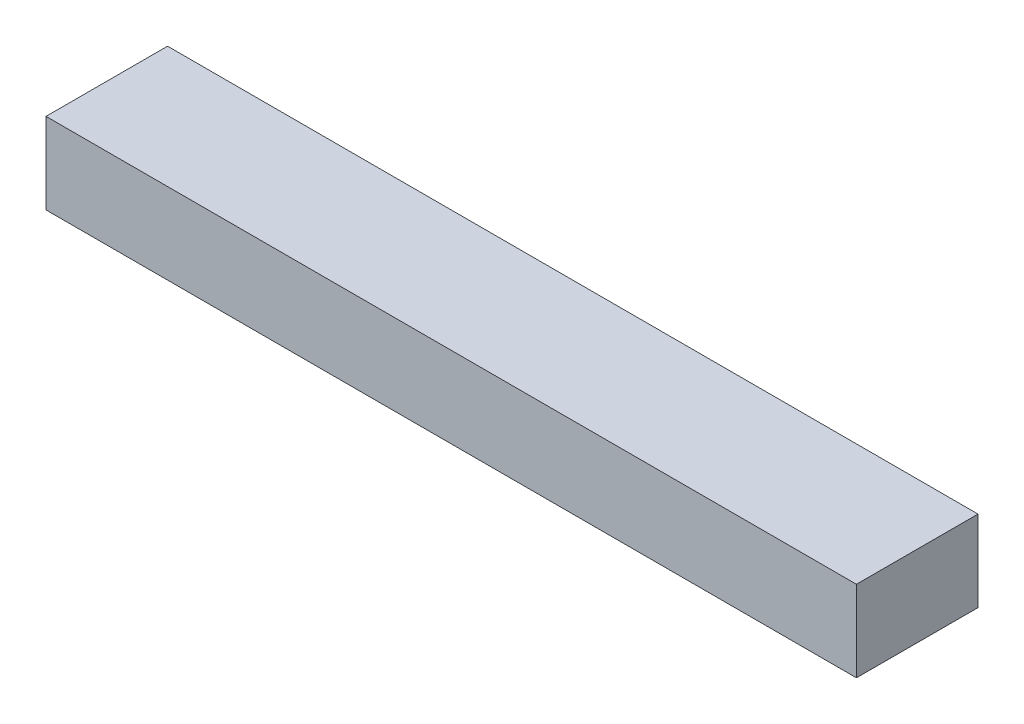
ISO-10303-21;
HEADER;
FILE_DESCRIPTION(('STEP AP214'),'2;1');
FILE_NAME('part.step','',(''),(''),'','','');
FILE_SCHEMA(('AUTOMOTIVE_DESIGN { 1 0 10303 214 1 1 1 1 }'));
ENDSEC;
DATA;
#1=APPLICATION_CONTEXT('core data for automotive mechanical design processes');
#2=APPLICATION_PROTOCOL_DEFINITION('international standard','automotive_design',2000,#1);
#3=PRODUCT_CONTEXT('',#1,'mechanical');
#4=PRODUCT('Part','Part','',(#3));
#5=PRODUCT_RELATED_PRODUCT_CATEGORY('part','',(#4));
#6=PRODUCT_DEFINITION_FORMATION('','',#4);
#7=PRODUCT_DEFINITION_CONTEXT('part definition',#1,'design');
#8=PRODUCT_DEFINITION('design','',#6,#7);
#9=PRODUCT_DEFINITION_SHAPE('','',#8);
#10=(LENGTH_UNIT() NAMED_UNIT(*) SI_UNIT(.MILLI.,.METRE.));
#11=(NAMED_UNIT(*) PLANE_ANGLE_UNIT() SI_UNIT($,.RADIAN.));
#12=(NAMED_UNIT(*) SI_UNIT($,.STERADIAN.) SOLID_ANGLE_UNIT());
#13=UNCERTAINTY_MEASURE_WITH_UNIT(LENGTH_MEASURE(1.E-05),#10,'distance_accuracy_value','');
#14=(GEOMETRIC_REPRESENTATION_CONTEXT(3) GLOBAL_UNCERTAINTY_ASSIGNED_CONTEXT((#13)) GLOBAL_UNIT_ASSIGNED_CONTEXT((#10,
#11,#12)) REPRESENTATION_CONTEXT('',''));
#15=CARTESIAN_POINT('',(0.,0.,0.));
#16=DIRECTION('',(0.,0.,1.));
#17=DIRECTION('',(1.,0.,0.));
#18=AXIS2_PLACEMENT_3D('',#15,#16,#17);
#19=CARTESIAN_POINT('',(0.,-16.8167216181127,0.));
#20=DIRECTION('',(0.,-1.,0.));
#21=DIRECTION('',(0.,0.,-1.));
#22=AXIS2_PLACEMENT_3D('',#19,#20,#21);
#23=PLANE('',#22);
#24=DIRECTION('',(0.,0.,-1.));
#25=VECTOR('',#24,1.);
#26=CARTESIAN_POINT('',(21.5,-16.8167216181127,19.460019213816));
#27=LINE('',#26,#25);
#28=CARTESIAN_POINT('',(21.5,-16.8167216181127,18.460019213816));
#29=VERTEX_POINT('',#28);
#30=CARTESIAN_POINT('',(21.5,-16.8167216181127,16.960019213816));
#31=VERTEX_POINT('',#30);
#32=EDGE_CURVE('E68',#29,#31,#27,.T.);
#33=ORIENTED_EDGE('',*,*,#32,.F.);
#34=DIRECTION('',(1.,0.,0.));
#35=VECTOR('',#34,1.);
#36=CARTESIAN_POINT('',(9.8228756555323,-16.8167216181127,18.460019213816));
#37=LINE('',#36,#35);
#38=CARTESIAN_POINT('',(11.5,-16.8167216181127,18.460019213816));
#39=VERTEX_POINT('',#38);
#40=EDGE_CURVE('E61',#39,#29,#37,.T.);
#41=ORIENTED_EDGE('',*,*,#40,.F.);
#42=DIRECTION('',(0.,0.,-1.));
#43=VECTOR('',#42,1.);
#44=CARTESIAN_POINT('',(11.5,-16.8167216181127,0.));
#45=LINE('',#44,#43);
#46=CARTESIAN_POINT('',(11.5,-16.8167216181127,16.960019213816));
#47=VERTEX_POINT('',#46);
#48=EDGE_CURVE('E20',#39,#47,#45,.T.);
#49=ORIENTED_EDGE('',*,*,#48,.T.);
#50=DIRECTION('',(1.,0.,0.));
#51=VECTOR('',#50,1.);
#52=CARTESIAN_POINT('',(11.5,-16.8167216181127,16.960019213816));
#53=LINE('',#52,#51);
#54=EDGE_CURVE('E55',#47,#31,#53,.T.);
#55=ORIENTED_EDGE('',*,*,#54,.T.);
#56=EDGE_LOOP('',(#33,#41,#49,#55));
#57=FACE_BOUND('',#56,.T.);
#58=ADVANCED_FACE('F17',(#57),#23,.T.);
#59=CARTESIAN_POINT('',(9.8228756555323,3.18527838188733,18.460019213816));
#60=DIRECTION('',(0.,0.,1.));
#61=DIRECTION('',(1.,0.,0.));
#62=AXIS2_PLACEMENT_3D('',#59,#60,#61);
#63=PLANE('',#62);
#64=DIRECTION('',(0.,1.,0.));
#65=VECTOR('',#64,1.);
#66=CARTESIAN_POINT('',(11.5,-12.8167216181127,18.460019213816));
#67=LINE('',#66,#65);
#68=CARTESIAN_POINT('',(11.5,-15.8167216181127,18.460019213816));
#69=VERTEX_POINT('',#68);
#70=EDGE_CURVE('E67',#39,#69,#67,.T.);
#71=ORIENTED_EDGE('',*,*,#70,.F.);
#72=ORIENTED_EDGE('',*,*,#40,.T.);
#73=DIRECTION('',(0.,1.,0.));
#74=VECTOR('',#73,1.);
#75=CARTESIAN_POINT('',(21.5,-12.8167216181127,18.460019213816));
#76=LINE('',#75,#74);
#77=CARTESIAN_POINT('',(21.5,-15.8167216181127,18.460019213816));
#78=VERTEX_POINT('',#77);
#79=EDGE_CURVE('E64',#78,#29,#76,.F.);
#80=ORIENTED_EDGE('',*,*,#79,.F.);
#81=DIRECTION('',(1.,0.,0.));
#82=VECTOR('',#81,1.);
#83=CARTESIAN_POINT('',(0.,-15.8167216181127,18.460019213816));
#84=LINE('',#83,#82);
#85=EDGE_CURVE('E83',#69,#78,#84,.T.);
#86=ORIENTED_EDGE('',*,*,#85,.F.);
#87=EDGE_LOOP('',(#71,#72,#80,#86));
#88=FACE_BOUND('',#87,.T.);
#89=ADVANCED_FACE('F62',(#88),#63,.T.);
#90=CARTESIAN_POINT('',(21.5,-12.8167216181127,19.460019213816));
#91=DIRECTION('',(1.,0.,0.));
#92=DIRECTION('',(0.,0.,-1.));
#93=AXIS2_PLACEMENT_3D('',#90,#91,#92);
#94=PLANE('',#93);
#95=ORIENTED_EDGE('',*,*,#79,.T.);
#96=ORIENTED_EDGE('',*,*,#32,.T.);
#97=DIRECTION('',(0.,1.,0.));
#98=VECTOR('',#97,1.);
#99=CARTESIAN_POINT('',(21.5,-16.8167216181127,16.960019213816));
#100=LINE('',#99,#98);
#101=CARTESIAN_POINT('',(21.5,-15.8167216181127,16.960019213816));
#102=VERTEX_POINT('',#101);
#103=EDGE_CURVE('E79',#31,#102,#100,.T.);
#104=ORIENTED_EDGE('',*,*,#103,.T.);
#105=DIRECTION('',(0.,0.,1.));
#106=VECTOR('',#105,1.);
#107=CARTESIAN_POINT('',(21.5,-15.8167216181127,0.));
#108=LINE('',#107,#106);
#109=EDGE_CURVE('E74',#78,#102,#108,.F.);
#110=ORIENTED_EDGE('',*,*,#109,.F.);
#111=EDGE_LOOP('',(#95,#96,#104,#110));
#112=FACE_BOUND('',#111,.T.);
#113=ADVANCED_FACE('F72',(#112),#94,.T.);
#114=CARTESIAN_POINT('',(11.5,-16.8167216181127,16.960019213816));
#115=DIRECTION('',(0.,0.,1.));
#116=DIRECTION('',(1.,0.,0.));
#117=AXIS2_PLACEMENT_3D('',#114,#115,#116);
#118=PLANE('',#117);
#119=DIRECTION('',(1.,0.,0.));
#120=VECTOR('',#119,1.);
#121=CARTESIAN_POINT('',(0.,-15.8167216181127,16.960019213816));
#122=LINE('',#121,#120);
#123=CARTESIAN_POINT('',(11.5,-15.8167216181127,16.960019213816));
#124=VERTEX_POINT('',#123);
#125=EDGE_CURVE('E26',#102,#124,#122,.F.);
#126=ORIENTED_EDGE('',*,*,#125,.F.);
#127=ORIENTED_EDGE('',*,*,#103,.F.);
#128=ORIENTED_EDGE('',*,*,#54,.F.);
#129=DIRECTION('',(0.,1.,0.));
#130=VECTOR('',#129,1.);
#131=CARTESIAN_POINT('',(11.5,-12.8167216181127,16.960019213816));
#132=LINE('',#131,#130);
#133=EDGE_CURVE('E35',#124,#47,#132,.F.);
#134=ORIENTED_EDGE('',*,*,#133,.F.);
#135=EDGE_LOOP('',(#126,#127,#128,#134));
#136=FACE_BOUND('',#135,.T.);
#137=ADVANCED_FACE('F89',(#136),#118,.F.);
#138=CARTESIAN_POINT('',(11.5,-12.8167216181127,19.460019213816));
#139=DIRECTION('',(-1.,0.,0.));
#140=DIRECTION('',(0.,0.,1.));
#141=AXIS2_PLACEMENT_3D('',#138,#139,#140);
#142=PLANE('',#141);
#143=ORIENTED_EDGE('',*,*,#133,.T.);
#144=ORIENTED_EDGE('',*,*,#48,.F.);
#145=ORIENTED_EDGE('',*,*,#70,.T.);
#146=DIRECTION('',(0.,0.,1.));
#147=VECTOR('',#146,1.);
#148=CARTESIAN_POINT('',(11.5,-15.8167216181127,0.));
#149=LINE('',#148,#147);
#150=EDGE_CURVE('E11',#124,#69,#149,.T.);
#151=ORIENTED_EDGE('',*,*,#150,.F.);
#152=EDGE_LOOP('',(#143,#144,#145,#151));
#153=FACE_BOUND('',#152,.T.);
#154=ADVANCED_FACE('F91',(#153),#142,.T.);
#155=CARTESIAN_POINT('',(0.,-15.8167216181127,0.));
#156=DIRECTION('',(0.,1.,0.));
#157=DIRECTION('',(0.,0.,1.));
#158=AXIS2_PLACEMENT_3D('',#155,#156,#157);
#159=PLANE('',#158);
#160=ORIENTED_EDGE('',*,*,#125,.T.);
#161=ORIENTED_EDGE('',*,*,#150,.T.);
#162=ORIENTED_EDGE('',*,*,#85,.T.);
#163=ORIENTED_EDGE('',*,*,#109,.T.);
#164=EDGE_LOOP('',(#160,#161,#162,#163));
#165=FACE_BOUND('',#164,.T.);
#166=ADVANCED_FACE('F88',(#165),#159,.T.);
#167=CLOSED_SHELL('',(#58,#89,#113,#137,#154,#166));
#168=MANIFOLD_SOLID_BREP('B1',#167);
#169=ADVANCED_BREP_SHAPE_REPRESENTATION('',(#18,#168),#14);
#170=SHAPE_DEFINITION_REPRESENTATION(#9,#169);
ENDSEC;
END-ISO-10303-21;
